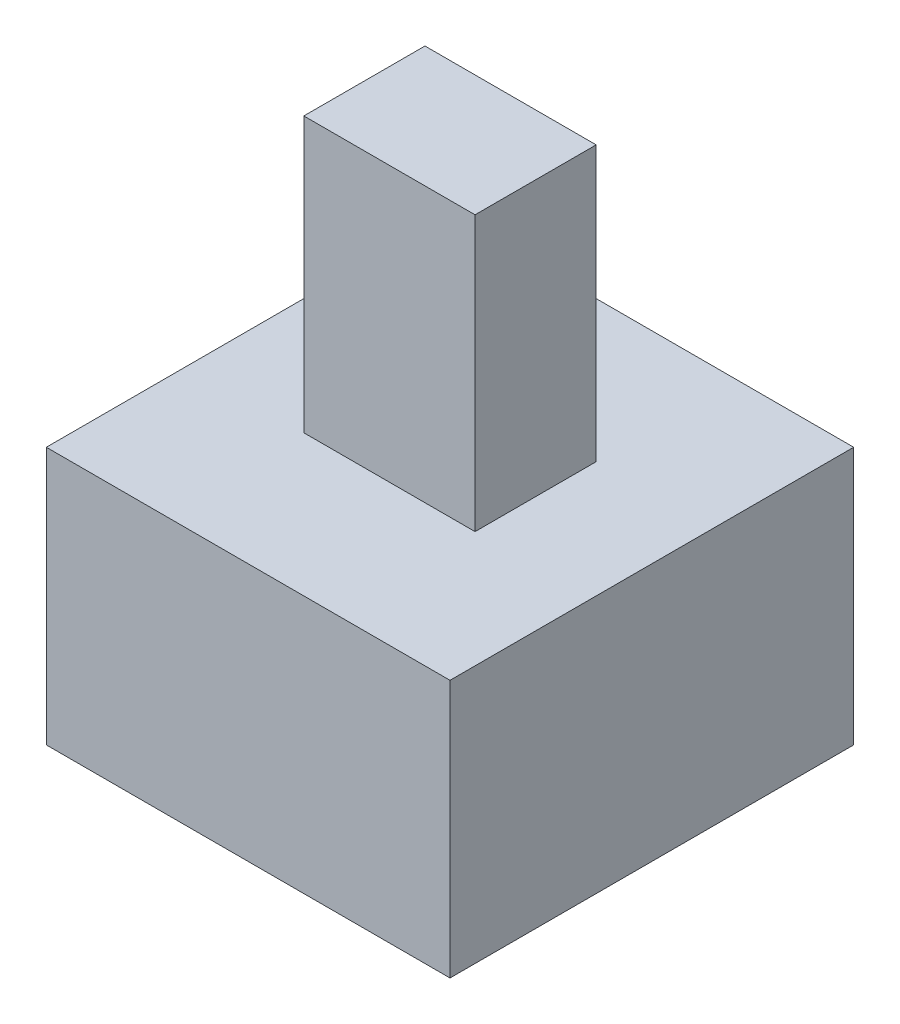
from build123d import *

# Parameters (mm, degrees)
SKETCH1_W      = 97.52724138
SKETCH1_H      = 97.52724138
EXTRUDE1_DEPTH = 62.290520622
SKETCH2_W      = 41.364612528
SKETCH2_H      = 29.265481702
EXTRUDE2_DEPTH = 66.296473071


with BuildPart() as part:
    # Sketch1 → Extrude1 (new body)
    with BuildSketch(Plane(origin=(0, 0, 0), x_dir=(1, 0, 0), z_dir=(0, 1, 0))):
        Rectangle(SKETCH1_W, SKETCH1_H)
    extrude(amount=EXTRUDE1_DEPTH)

    # Sketch2 → Extrude2 (add)
    with BuildSketch(Plane(origin=(0, 62.290520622, 0), x_dir=(-1, 0, 0), z_dir=(0, 1, 0))):
        Rectangle(SKETCH2_W, SKETCH2_H)
    extrude(amount=EXTRUDE2_DEPTH)


solid = part.part
